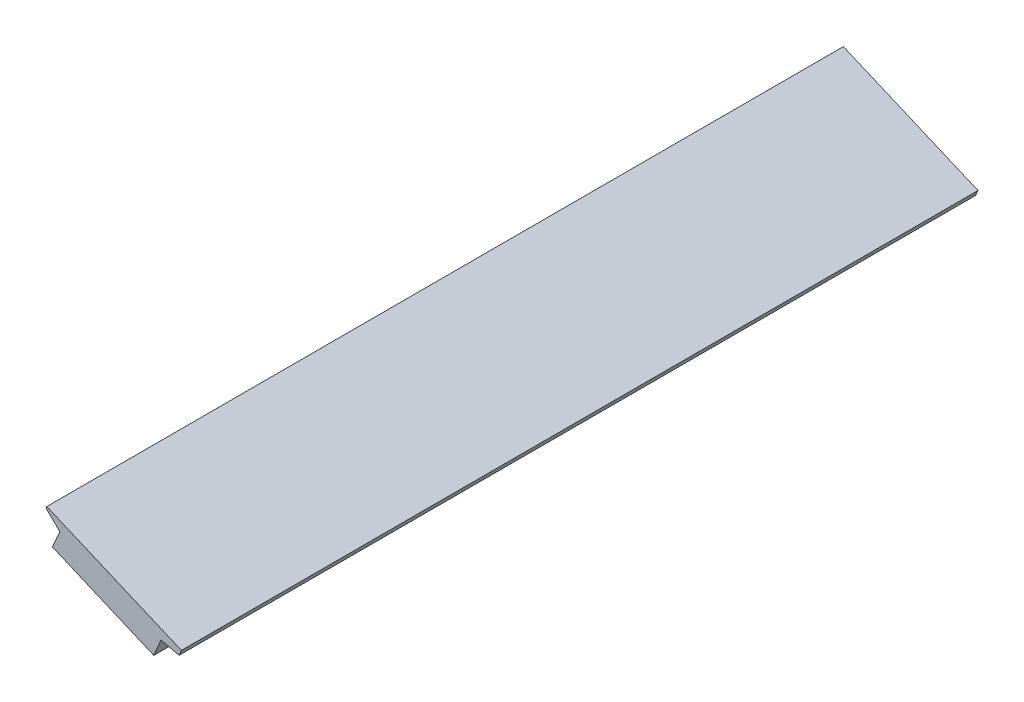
from build123d import *

# Parameters (mm, degrees)
EXTRUDE1_DEPTH = 43.5


with BuildPart() as part:
    # Sketch1 → Extrude1 (new, symmetric)
    with BuildSketch(Plane.XY):
        Polygon((-20.786694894, -19.219648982), (-31.869650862, -14.502734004), (-31.038130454, -12.664456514), (-32.560367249, -11.176944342), (-32.473662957, -10.985263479), (-17.77132802, -17.242589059), (-18.021692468, -17.830850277), (-20, -17.371868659), align=None)
    extrude(amount=EXTRUDE1_DEPTH, both=True)


solid = part.part
